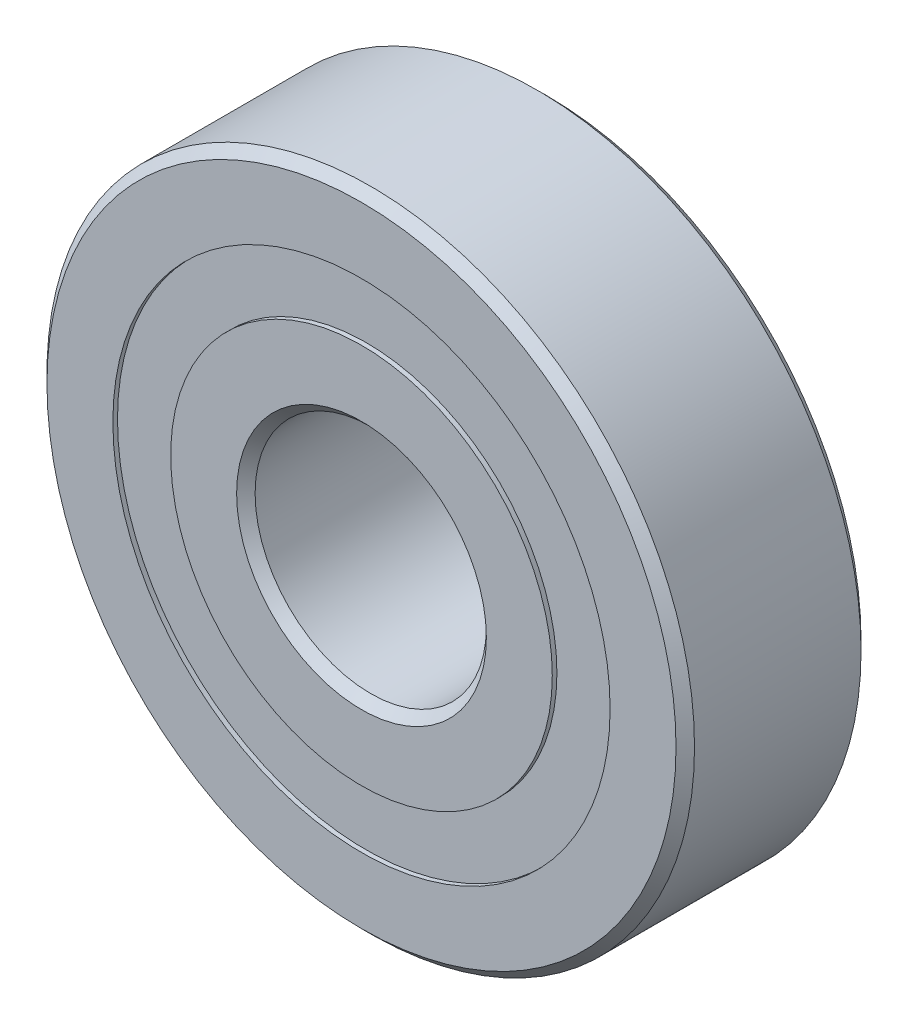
from build123d import *

# Parameters (mm, degrees)
CIRPATTERN1_COUNT = 10
SKETCH5_W         = 1.626755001
SKETCH5_H         = 2.5


with BuildPart() as part:
    # Sketch3 → Revolve1 (revolve)
    with BuildSketch(Plane(origin=(0, 0, 0), x_dir=(0, 0, -1), z_dir=(1, 0, 0)), mode=Mode.PRIVATE) as revolve1_sk:
        with BuildLine():
            Line((-4, 13.6), (-4, 10.75))
            Line((-4, 10.75), (-1.777777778, 10.75))
            ThreePointArc((-1.777777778, 10.75), (0, 11.673244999), (1.777777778, 10.75))
            Line((1.777777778, 10.75), (4, 10.75))
            Line((4, 10.75), (4, 13.6))
            Line((4, 13.6), (3.6, 14))
            Line((3.6, 14), (-3.6, 14))
            Line((-3.6, 14), (-4, 13.6))
        make_face()
        with BuildLine():
            Line((-4, 5.4), (-4, 8.25))
            Line((-4, 8.25), (-1.777777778, 8.25))
            ThreePointArc((-1.777777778, 8.25), (0, 7.326755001), (1.777777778, 8.25))
            Line((1.777777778, 8.25), (4, 8.25))
            Line((4, 8.25), (4, 5.4))
            Line((4, 5.4), (3.6, 5))
            Line((3.6, 5), (-3.6, 5))
            Line((-3.6, 5), (-4, 5.4))
        make_face()
    revolve(revolve1_sk.sketch.rotate(Axis((0, 0, 4), (0, 0, -1)), 90), axis=Axis((0, 0, 4), (0, 0, -1)))


with BuildPart() as body_2:
    # Sketch4 → Revolve2 (revolve)
    with BuildSketch(Plane(origin=(0, 0, 0), x_dir=(0, 0, -1), z_dir=(1, 0, 0))):
        with BuildLine():
            Line((-2.173244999, 9.5), (2.173244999, 9.5))
            ThreePointArc((2.173244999, 9.5), (0, 11.673244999), (-2.173244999, 9.5))
        make_face()
    revolve(axis=Axis((0, 9.5, 2.173244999), (0, 0, -1)))


with BuildPart() as cirpattern1_1:
    # CirPattern1: pattern copy
    add(body_2.part.rotate(Axis((0, 0, 0), (0, 0, 1)), 1 * 360 / CIRPATTERN1_COUNT))


with BuildPart() as cirpattern1_2:
    # CirPattern1: pattern copy
    add(body_2.part.rotate(Axis((0, 0, 0), (0, 0, 1)), 2 * 360 / CIRPATTERN1_COUNT))


with BuildPart() as cirpattern1_3:
    # CirPattern1: pattern copy
    add(body_2.part.rotate(Axis((0, 0, 0), (0, 0, 1)), 3 * 360 / CIRPATTERN1_COUNT))


with BuildPart() as cirpattern1_4:
    # CirPattern1: pattern copy
    add(body_2.part.rotate(Axis((0, 0, 0), (0, 0, 1)), 4 * 360 / CIRPATTERN1_COUNT))


with BuildPart() as cirpattern1_5:
    # CirPattern1: pattern copy
    add(body_2.part.rotate(Axis((0, 0, 0), (0, 0, 1)), 5 * 360 / CIRPATTERN1_COUNT))


with BuildPart() as cirpattern1_6:
    # CirPattern1: pattern copy
    add(body_2.part.rotate(Axis((0, 0, 0), (0, 0, 1)), 6 * 360 / CIRPATTERN1_COUNT))


with BuildPart() as cirpattern1_7:
    # CirPattern1: pattern copy
    add(body_2.part.rotate(Axis((0, 0, 0), (0, 0, 1)), 7 * 360 / CIRPATTERN1_COUNT))


with BuildPart() as cirpattern1_8:
    # CirPattern1: pattern copy
    add(body_2.part.rotate(Axis((0, 0, 0), (0, 0, 1)), 8 * 360 / CIRPATTERN1_COUNT))


with BuildPart() as cirpattern1_9:
    # CirPattern1: pattern copy
    add(body_2.part.rotate(Axis((0, 0, 0), (0, 0, 1)), 9 * 360 / CIRPATTERN1_COUNT))


with BuildPart() as body_12:
    # Sketch5 → Revolve3 (revolve)
    with BuildSketch(Plane(origin=(0, 0, 0), x_dir=(0, 0, -1), z_dir=(1, 0, 0)), mode=Mode.PRIVATE) as revolve3_sk:
        with Locations((-2.9866225, 9.5)):
            Rectangle(SKETCH5_W, SKETCH5_H)
        with Locations((2.9866225, 9.5)):
            Rectangle(SKETCH5_W, SKETCH5_H)
    revolve(revolve3_sk.sketch.rotate(Axis((0, 0, 4), (0, 0, -1)), 90), axis=Axis((0, 0, 4), (0, 0, -1)))


solid = Compound([part.part, body_2.part, cirpattern1_1.part, cirpattern1_2.part, cirpattern1_3.part, cirpattern1_4.part, cirpattern1_5.part, cirpattern1_6.part, cirpattern1_7.part, cirpattern1_8.part, cirpattern1_9.part, body_12.part])
